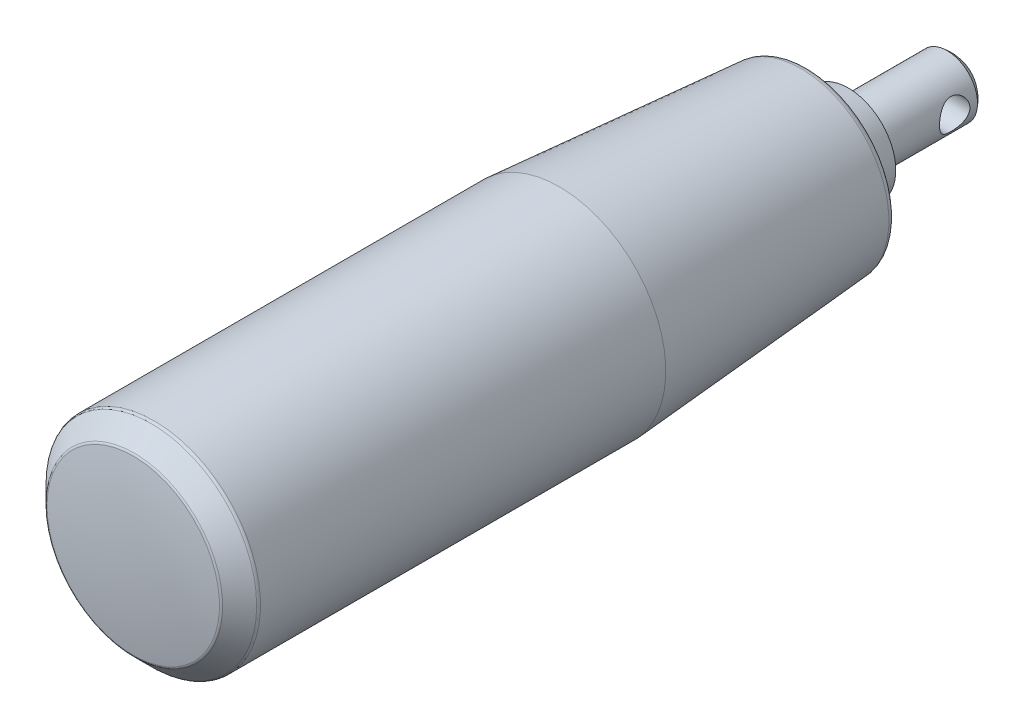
ISO-10303-21;
HEADER;
FILE_DESCRIPTION(('STEP AP214'),'2;1');
FILE_NAME('part.step','',(''),(''),'','','');
FILE_SCHEMA(('AUTOMOTIVE_DESIGN { 1 0 10303 214 1 1 1 1 }'));
ENDSEC;
DATA;
#1=APPLICATION_CONTEXT('core data for automotive mechanical design processes');
#2=APPLICATION_PROTOCOL_DEFINITION('international standard','automotive_design',2000,#1);
#3=PRODUCT_CONTEXT('',#1,'mechanical');
#4=PRODUCT('Part','Part','',(#3));
#5=PRODUCT_RELATED_PRODUCT_CATEGORY('part','',(#4));
#6=PRODUCT_DEFINITION_FORMATION('','',#4);
#7=PRODUCT_DEFINITION_CONTEXT('part definition',#1,'design');
#8=PRODUCT_DEFINITION('design','',#6,#7);
#9=PRODUCT_DEFINITION_SHAPE('','',#8);
#10=(LENGTH_UNIT() NAMED_UNIT(*) SI_UNIT(.MILLI.,.METRE.));
#11=(NAMED_UNIT(*) PLANE_ANGLE_UNIT() SI_UNIT($,.RADIAN.));
#12=(NAMED_UNIT(*) SI_UNIT($,.STERADIAN.) SOLID_ANGLE_UNIT());
#13=UNCERTAINTY_MEASURE_WITH_UNIT(LENGTH_MEASURE(1.E-05),#10,'distance_accuracy_value','');
#14=(GEOMETRIC_REPRESENTATION_CONTEXT(3) GLOBAL_UNCERTAINTY_ASSIGNED_CONTEXT((#13)) GLOBAL_UNIT_ASSIGNED_CONTEXT((#10,
#11,#12)) REPRESENTATION_CONTEXT('',''));
#15=CARTESIAN_POINT('',(0.,0.,0.));
#16=DIRECTION('',(0.,0.,1.));
#17=DIRECTION('',(1.,0.,0.));
#18=AXIS2_PLACEMENT_3D('',#15,#16,#17);
#19=CARTESIAN_POINT('',(0.,0.,38.375));
#20=DIRECTION('',(1.,0.,0.));
#21=DIRECTION('',(0.,0.,-1.));
#22=AXIS2_PLACEMENT_3D('',#19,#20,#21);
#23=SPHERICAL_SURFACE('',#22,66.625);
#24=CARTESIAN_POINT('',(0.,0.,38.375));
#25=DIRECTION('',(0.,0.,-1.));
#26=DIRECTION('',(-1.,0.,0.));
#27=AXIS2_PLACEMENT_3D('',#24,#25,#26);
#28=SPHERICAL_SURFACE('',#27,66.625);
#29=CARTESIAN_POINT('',(0.,0.,104.027234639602));
#30=DIRECTION('',(0.,0.,-1.));
#31=DIRECTION('',(-1.,0.,0.));
#32=AXIS2_PLACEMENT_3D('',#29,#30,#31);
#33=CIRCLE('',#32,11.343487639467);
#34=CARTESIAN_POINT('',(-11.343487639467,0.,104.027234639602));
#35=VERTEX_POINT('',#34);
#36=EDGE_CURVE('E105',#35,#35,#33,.T.);
#37=ORIENTED_EDGE('',*,*,#36,.F.);
#38=EDGE_LOOP('',(#37));
#39=FACE_BOUND('',#38,.T.);
#40=ADVANCED_FACE('F12',(#39),#28,.T.);
#41=CARTESIAN_POINT('',(0.,0.,0.));
#42=DIRECTION('',(1.,0.,0.));
#43=DIRECTION('',(0.,0.,-1.));
#44=AXIS2_PLACEMENT_3D('',#41,#42,#43);
#45=SPHERICAL_SURFACE('',#44,5.);
#46=CARTESIAN_POINT('',(0.,0.,0.));
#47=DIRECTION('',(0.,0.,-1.));
#48=DIRECTION('',(-1.,0.,0.));
#49=AXIS2_PLACEMENT_3D('',#46,#47,#48);
#50=SPHERICAL_SURFACE('',#49,5.);
#51=CARTESIAN_POINT('',(0.,0.,-3.));
#52=DIRECTION('',(0.,0.,-1.));
#53=DIRECTION('',(-1.,0.,0.));
#54=AXIS2_PLACEMENT_3D('',#51,#52,#53);
#55=CIRCLE('',#54,4.);
#56=CARTESIAN_POINT('',(-4.,0.,-3.));
#57=VERTEX_POINT('',#56);
#58=EDGE_CURVE('E8',#57,#57,#55,.T.);
#59=ORIENTED_EDGE('',*,*,#58,.T.);
#60=EDGE_LOOP('',(#59));
#61=FACE_BOUND('',#60,.T.);
#62=ADVANCED_FACE('F93',(#61),#50,.T.);
#63=CARTESIAN_POINT('',(0.,0.,-8.));
#64=DIRECTION('',(0.,0.,-1.));
#65=DIRECTION('',(-1.,0.,0.));
#66=AXIS2_PLACEMENT_3D('',#63,#64,#65);
#67=CYLINDRICAL_SURFACE('',#66,4.);
#68=CARTESIAN_POINT('',(-4.,0.,2.));
#69=CARTESIAN_POINT('',(-3.99999426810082,0.1051439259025,1.99999339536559));
#70=CARTESIAN_POINT('',(-3.99580982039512,0.21041319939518,1.99165985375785));
#71=CARTESIAN_POINT('',(-3.97948312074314,0.417840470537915,1.95869423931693));
#72=CARTESIAN_POINT('',(-3.9673257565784,0.519992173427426,1.93403121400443));
#73=CARTESIAN_POINT('',(-3.93632558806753,0.717867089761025,1.86961238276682));
#74=CARTESIAN_POINT('',(-3.91750878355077,0.813613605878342,1.82991523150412));
#75=CARTESIAN_POINT('',(-3.87491553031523,0.996945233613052,1.73685875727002));
#76=CARTESIAN_POINT('',(-3.85113947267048,1.08453098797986,1.68350051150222));
#77=CARTESIAN_POINT('',(-3.79912516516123,1.25501563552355,1.56096550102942));
#78=CARTESIAN_POINT('',(-3.77070398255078,1.33731042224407,1.49102704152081));
#79=CARTESIAN_POINT('',(-3.71319940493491,1.48955888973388,1.33895704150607));
#80=CARTESIAN_POINT('',(-3.68411552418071,1.55950316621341,1.25681629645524));
#81=CARTESIAN_POINT('',(-3.62597902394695,1.69050400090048,1.07503330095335));
#82=CARTESIAN_POINT('',(-3.59710373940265,1.7504506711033,0.974527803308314));
#83=CARTESIAN_POINT('',(-3.54571957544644,1.85233645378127,0.763265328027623));
#84=CARTESIAN_POINT('',(-3.52320615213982,1.8942884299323,0.652515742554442));
#85=CARTESIAN_POINT('',(-3.48915734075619,1.95626488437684,0.430669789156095));
#86=CARTESIAN_POINT('',(-3.47704543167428,1.97745171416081,0.319991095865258));
#87=CARTESIAN_POINT('',(-3.46363779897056,2.00085398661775,0.0960423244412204));
#88=CARTESIAN_POINT('',(-3.46233138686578,2.00308817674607,-0.0172250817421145));
#89=CARTESIAN_POINT('',(-3.47021860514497,1.98937457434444,-0.228572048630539));
#90=CARTESIAN_POINT('',(-3.47817527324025,1.97556911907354,-0.326848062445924));
#91=CARTESIAN_POINT('',(-3.50152457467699,1.93387969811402,-0.519443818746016));
#92=CARTESIAN_POINT('',(-3.51691957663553,1.90599124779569,-0.613762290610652));
#93=CARTESIAN_POINT('',(-3.55374952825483,1.83641956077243,-0.798458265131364));
#94=CARTESIAN_POINT('',(-3.57531681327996,1.7944301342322,-0.888692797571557));
#95=CARTESIAN_POINT('',(-3.62206808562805,1.69808337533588,-1.06126858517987));
#96=CARTESIAN_POINT('',(-3.64725369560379,1.64372048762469,-1.14360627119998));
#97=CARTESIAN_POINT('',(-3.70226315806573,1.51613210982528,-1.30904250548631));
#98=CARTESIAN_POINT('',(-3.73227020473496,1.44138891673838,-1.39091374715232));
#99=CARTESIAN_POINT('',(-3.79095246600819,1.27911115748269,-1.54147083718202));
#100=CARTESIAN_POINT('',(-3.81962703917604,1.19157051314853,-1.61015038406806));
#101=CARTESIAN_POINT('',(-3.87403974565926,1.0010330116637,-1.73537132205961));
#102=CARTESIAN_POINT('',(-3.89957968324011,0.897507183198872,-1.79120094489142));
#103=CARTESIAN_POINT('',(-3.94315762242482,0.680932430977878,-1.88419405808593));
#104=CARTESIAN_POINT('',(-3.96120157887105,0.567891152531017,-1.92137237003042));
#105=CARTESIAN_POINT('',(-3.98648667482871,0.345532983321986,-1.97295080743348));
#106=CARTESIAN_POINT('',(-3.99449876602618,0.236683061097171,-1.98898247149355));
#107=CARTESIAN_POINT('',(-4.00146026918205,0.0175591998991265,-2.00292946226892));
#108=CARTESIAN_POINT('',(-4.00041397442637,-0.0927140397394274,-2.00085337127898));
#109=CARTESIAN_POINT('',(-3.9898238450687,-0.302465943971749,-1.97958662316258));
#110=CARTESIAN_POINT('',(-3.98094491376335,-0.402118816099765,-1.96173493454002));
#111=CARTESIAN_POINT('',(-3.95644342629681,-0.59681378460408,-1.91152385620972));
#112=CARTESIAN_POINT('',(-3.94082012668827,-0.691855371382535,-1.87916286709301));
#113=CARTESIAN_POINT('',(-3.90368502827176,-0.877777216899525,-1.80000306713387));
#114=CARTESIAN_POINT('',(-3.88201763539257,-0.968460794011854,-1.7528178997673));
#115=CARTESIAN_POINT('',(-3.83487948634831,-1.14092272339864,-1.64578492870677));
#116=CARTESIAN_POINT('',(-3.80940711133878,-1.22269725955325,-1.58593173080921));
#117=CARTESIAN_POINT('',(-3.75416442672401,-1.38353537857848,-1.44847914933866));
#118=CARTESIAN_POINT('',(-3.72421769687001,-1.4615441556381,-1.36971426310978));
#119=CARTESIAN_POINT('',(-3.6652478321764,-1.60371264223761,-1.20014969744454));
#120=CARTESIAN_POINT('',(-3.63622534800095,-1.6678627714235,-1.10934176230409));
#121=CARTESIAN_POINT('',(-3.58102384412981,-1.78341582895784,-0.912712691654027));
#122=CARTESIAN_POINT('',(-3.55505059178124,-1.83405099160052,-0.806377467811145));
#123=CARTESIAN_POINT('',(-3.51148144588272,-1.91616565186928,-0.58497986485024));
#124=CARTESIAN_POINT('',(-3.49387476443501,-1.94766983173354,-0.469928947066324));
#125=CARTESIAN_POINT('',(-3.47123002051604,-1.9877233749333,-0.246179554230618));
#126=CARTESIAN_POINT('',(-3.4651476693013,-1.99818599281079,-0.137931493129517));
#127=CARTESIAN_POINT('',(-3.46330709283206,-2.00137830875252,0.0788941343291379));
#128=CARTESIAN_POINT('',(-3.46754439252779,-1.99411569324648,0.187471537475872));
#129=CARTESIAN_POINT('',(-3.48475724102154,-1.96385225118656,0.3909670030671));
#130=CARTESIAN_POINT('',(-3.49686188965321,-1.94241662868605,0.486200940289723));
#131=CARTESIAN_POINT('',(-3.52742032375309,-1.8863507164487,0.671616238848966));
#132=CARTESIAN_POINT('',(-3.54587615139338,-1.85171618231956,0.761795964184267));
#133=CARTESIAN_POINT('',(-3.5885706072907,-1.76763149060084,0.941249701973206));
#134=CARTESIAN_POINT('',(-3.61311444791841,-1.7173422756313,1.03005580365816));
#135=CARTESIAN_POINT('',(-3.66470663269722,-1.60430194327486,1.19854907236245));
#136=CARTESIAN_POINT('',(-3.69175627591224,-1.54154434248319,1.278231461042));
#137=CARTESIAN_POINT('',(-3.74924646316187,-1.39640665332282,1.43628396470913));
#138=CARTESIAN_POINT('',(-3.77969966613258,-1.31256884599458,1.51331820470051));
#139=CARTESIAN_POINT('',(-3.8375550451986,-1.13230961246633,1.65252596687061));
#140=CARTESIAN_POINT('',(-3.86495557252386,-1.03588144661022,1.71469147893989));
#141=CARTESIAN_POINT('',(-3.91396019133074,-0.831863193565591,1.82247272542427));
#142=CARTESIAN_POINT('',(-3.93552192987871,-0.724199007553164,1.86796833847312));
#143=CARTESIAN_POINT('',(-3.97002682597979,-0.501484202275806,1.93961633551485));
#144=CARTESIAN_POINT('',(-3.98299446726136,-0.38645559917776,1.96582369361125));
#145=CARTESIAN_POINT('',(-3.99390923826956,-0.225203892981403,1.98779482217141));
#146=CARTESIAN_POINT('',(-3.99618730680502,-0.180323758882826,1.99236528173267));
#147=CARTESIAN_POINT('',(-3.99923393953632,-0.0903034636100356,1.99846933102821));
#148=CARTESIAN_POINT('',(-4.00000246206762,-0.0451632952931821,2.00000283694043));
#149=CARTESIAN_POINT('',(-4.,0.,2.));
#150=B_SPLINE_CURVE_WITH_KNOTS('',3,(#68,#69,#70,#71,#72,#73,#74,#75,#76,#77,#78,#79,#80,#81,
#82,#83,#84,#85,#86,#87,#88,#89,#90,#91,#92,#93,#94,#95,#96,#97,#98,#99,#100,#101,#102,#103,
#104,#105,#106,#107,#108,#109,#110,#111,#112,#113,#114,#115,#116,#117,#118,#119,#120,#121,#122,
#123,#124,#125,#126,#127,#128,#129,#130,#131,#132,#133,#134,#135,#136,#137,#138,#139,#140,#141,
#142,#143,#144,#145,#146,#147,#148,#149),.UNSPECIFIED.,.T.,.F.,(4,2,2,2,2,2,2,2,2,2,2,2,2,2,2,2,
2,2,2,2,2,2,2,2,2,2,2,2,2,2,2,2,2,2,2,2,2,2,2,2,4),(0.,0.315248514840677,0.631096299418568,
0.945724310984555,1.26032752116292,1.59396351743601,1.9278524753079,2.28763452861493,
2.64715895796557,2.9851602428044,3.3228271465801,3.6201142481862,3.9174960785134,
4.2218048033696,4.5262504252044,4.86929882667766,5.21251069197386,5.57166044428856,
5.930524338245,6.25966580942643,6.58865129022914,6.89213813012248,7.19565843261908,
7.50785712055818,7.82018901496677,8.16319221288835,8.50643177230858,8.86629364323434,
9.22569023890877,9.55058615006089,9.87534119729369,10.1691586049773,10.4630705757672,
10.7767291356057,11.0905512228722,11.4425048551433,11.7946476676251,12.1492802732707,
12.5028981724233,12.6383056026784,12.7737167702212),.UNSPECIFIED.);
#151=CARTESIAN_POINT('',(-4.,0.,2.));
#152=VERTEX_POINT('',#151);
#153=EDGE_CURVE('E15',#152,#152,#150,.T.);
#154=ORIENTED_EDGE('',*,*,#153,.F.);
#155=EDGE_LOOP('',(#154));
#156=FACE_BOUND('',#155,.T.);
#157=CARTESIAN_POINT('',(4.,0.,-2.));
#158=CARTESIAN_POINT('',(3.99999426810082,0.105143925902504,-1.99999339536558));
#159=CARTESIAN_POINT('',(3.99580982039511,0.210413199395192,-1.99165985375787));
#160=CARTESIAN_POINT('',(3.97948312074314,0.417840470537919,-1.95869423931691));
#161=CARTESIAN_POINT('',(3.96732575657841,0.519992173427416,-1.93403121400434));
#162=CARTESIAN_POINT('',(3.93632558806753,0.717867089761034,-1.86961238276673));
#163=CARTESIAN_POINT('',(3.91750878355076,0.813613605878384,-1.8299152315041));
#164=CARTESIAN_POINT('',(3.87491553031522,0.996945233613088,-1.73685875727));
#165=CARTESIAN_POINT('',(3.85113947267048,1.08453098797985,-1.68350051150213));
#166=CARTESIAN_POINT('',(3.79912516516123,1.25501563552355,-1.56096550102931));
#167=CARTESIAN_POINT('',(3.77070398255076,1.33731042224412,-1.49102704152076));
#168=CARTESIAN_POINT('',(3.71319940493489,1.48955888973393,-1.33895704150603));
#169=CARTESIAN_POINT('',(3.68411552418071,1.55950316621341,-1.25681629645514));
#170=CARTESIAN_POINT('',(3.62597902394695,1.69050400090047,-1.07503330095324));
#171=CARTESIAN_POINT('',(3.59710373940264,1.75045067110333,-0.974527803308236));
#172=CARTESIAN_POINT('',(3.54571957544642,1.85233645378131,-0.763265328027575));
#173=CARTESIAN_POINT('',(3.52320615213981,1.89428842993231,-0.652515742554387));
#174=CARTESIAN_POINT('',(3.48915734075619,1.95626488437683,-0.430669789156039));
#175=CARTESIAN_POINT('',(3.47704543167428,1.97745171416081,-0.319991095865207));
#176=CARTESIAN_POINT('',(3.46363779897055,2.00085398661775,-0.0960423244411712));
#177=CARTESIAN_POINT('',(3.46233138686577,2.00308817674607,0.0172250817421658));
#178=CARTESIAN_POINT('',(3.47021860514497,1.98937457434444,0.228572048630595));
#179=CARTESIAN_POINT('',(3.47817527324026,1.97556911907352,0.326848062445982));
#180=CARTESIAN_POINT('',(3.501524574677,1.93387969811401,0.519443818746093));
#181=CARTESIAN_POINT('',(3.51691957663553,1.9059912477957,0.613762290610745));
#182=CARTESIAN_POINT('',(3.55374952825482,1.83641956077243,0.798458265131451));
#183=CARTESIAN_POINT('',(3.57531681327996,1.79443013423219,0.888692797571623));
#184=CARTESIAN_POINT('',(3.62206808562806,1.69808337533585,1.06126858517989));
#185=CARTESIAN_POINT('',(3.6472536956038,1.64372048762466,1.14360627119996));
#186=CARTESIAN_POINT('',(3.70226315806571,1.51613210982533,1.30904250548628));
#187=CARTESIAN_POINT('',(3.73227020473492,1.44138891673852,1.39091374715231));
#188=CARTESIAN_POINT('',(3.79095246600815,1.27911115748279,1.54147083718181));
#189=CARTESIAN_POINT('',(3.81962703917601,1.1915705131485,1.61015038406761));
#190=CARTESIAN_POINT('',(3.87403974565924,1.00103301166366,1.73537132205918));
#191=CARTESIAN_POINT('',(3.89957968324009,0.897507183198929,1.79120094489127));
#192=CARTESIAN_POINT('',(3.9431576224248,0.680932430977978,1.88419405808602));
#193=CARTESIAN_POINT('',(3.96120157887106,0.567891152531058,1.92137237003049));
#194=CARTESIAN_POINT('',(3.98648667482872,0.34553298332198,1.97295080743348));
#195=CARTESIAN_POINT('',(3.99449876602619,0.236683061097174,1.98898247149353));
#196=CARTESIAN_POINT('',(4.00146026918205,0.017559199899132,2.00292946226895));
#197=CARTESIAN_POINT('',(4.00041397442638,-0.0927140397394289,2.00085337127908));
#198=CARTESIAN_POINT('',(3.98982384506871,-0.302465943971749,1.97958662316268));
#199=CARTESIAN_POINT('',(3.98094491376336,-0.402118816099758,1.96173493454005));
#200=CARTESIAN_POINT('',(3.95644342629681,-0.596813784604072,1.9115238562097));
#201=CARTESIAN_POINT('',(3.94082012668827,-0.691855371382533,1.879162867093));
#202=CARTESIAN_POINT('',(3.90368502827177,-0.877777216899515,1.80000306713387));
#203=CARTESIAN_POINT('',(3.88201763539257,-0.96846079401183,1.75281789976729));
#204=CARTESIAN_POINT('',(3.83487948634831,-1.14092272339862,1.64578492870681));
#205=CARTESIAN_POINT('',(3.80940711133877,-1.22269725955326,1.5859317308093));
#206=CARTESIAN_POINT('',(3.75416442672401,-1.38353537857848,1.44847914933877));
#207=CARTESIAN_POINT('',(3.72421769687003,-1.46154415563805,1.36971426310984));
#208=CARTESIAN_POINT('',(3.66524783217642,-1.60371264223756,1.20014969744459));
#209=CARTESIAN_POINT('',(3.63622534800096,-1.66786277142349,1.10934176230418));
#210=CARTESIAN_POINT('',(3.58102384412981,-1.78341582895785,0.91271269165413));
#211=CARTESIAN_POINT('',(3.55505059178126,-1.8340509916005,0.806377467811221));
#212=CARTESIAN_POINT('',(3.51148144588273,-1.91616565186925,0.58497986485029));
#213=CARTESIAN_POINT('',(3.49387476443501,-1.94766983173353,0.469928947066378));
#214=CARTESIAN_POINT('',(3.47123002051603,-1.98772337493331,0.246179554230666));
#215=CARTESIAN_POINT('',(3.4651476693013,-1.9981859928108,0.137931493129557));
#216=CARTESIAN_POINT('',(3.46330709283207,-2.00137830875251,-0.0788941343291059));
#217=CARTESIAN_POINT('',(3.46754439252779,-1.99411569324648,-0.18747153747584));
#218=CARTESIAN_POINT('',(3.48475724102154,-1.96385225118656,-0.390967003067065));
#219=CARTESIAN_POINT('',(3.49686188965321,-1.94241662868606,-0.486200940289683));
#220=CARTESIAN_POINT('',(3.52742032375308,-1.88635071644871,-0.671616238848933));
#221=CARTESIAN_POINT('',(3.54587615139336,-1.85171618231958,-0.761795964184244));
#222=CARTESIAN_POINT('',(3.58857060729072,-1.7676314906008,-0.941249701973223));
#223=CARTESIAN_POINT('',(3.61311444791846,-1.71734227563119,-1.0300558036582));
#224=CARTESIAN_POINT('',(3.66470663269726,-1.60430194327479,-1.19854907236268));
#225=CARTESIAN_POINT('',(3.69175627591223,-1.54154434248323,-1.27823146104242));
#226=CARTESIAN_POINT('',(3.74924646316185,-1.39640665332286,-1.43628396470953));
#227=CARTESIAN_POINT('',(3.7796996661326,-1.31256884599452,-1.51331820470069));
#228=CARTESIAN_POINT('',(3.83755504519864,-1.13230961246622,-1.65252596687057));
#229=CARTESIAN_POINT('',(3.86495557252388,-1.03588144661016,-1.71469147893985));
#230=CARTESIAN_POINT('',(3.91396019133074,-0.831863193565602,-1.82247272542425));
#231=CARTESIAN_POINT('',(3.93552192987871,-0.72419900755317,-1.86796833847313));
#232=CARTESIAN_POINT('',(3.97002682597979,-0.501484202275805,-1.93961633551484));
#233=CARTESIAN_POINT('',(3.98299446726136,-0.386455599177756,-1.9658236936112));
#234=CARTESIAN_POINT('',(3.99390923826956,-0.225203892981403,-1.98779482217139));
#235=CARTESIAN_POINT('',(3.99618730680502,-0.180323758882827,-1.99236528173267));
#236=CARTESIAN_POINT('',(3.99923393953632,-0.0903034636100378,-1.99846933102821));
#237=CARTESIAN_POINT('',(4.00000246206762,-0.0451632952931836,-2.00000283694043));
#238=CARTESIAN_POINT('',(4.,0.,-2.));
#239=B_SPLINE_CURVE_WITH_KNOTS('',3,(#157,#158,#159,#160,#161,#162,#163,#164,#165,#166,#167,
#168,#169,#170,#171,#172,#173,#174,#175,#176,#177,#178,#179,#180,#181,#182,#183,#184,#185,#186,
#187,#188,#189,#190,#191,#192,#193,#194,#195,#196,#197,#198,#199,#200,#201,#202,#203,#204,#205,
#206,#207,#208,#209,#210,#211,#212,#213,#214,#215,#216,#217,#218,#219,#220,#221,#222,#223,#224,
#225,#226,#227,#228,#229,#230,#231,#232,#233,#234,#235,#236,#237,#238),.UNSPECIFIED.,.T.,.F.,(4,
2,2,2,2,2,2,2,2,2,2,2,2,2,2,2,2,2,2,2,2,2,2,2,2,2,2,2,2,2,2,2,2,2,2,2,2,2,2,2,4),(0.,
0.315248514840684,0.631096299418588,0.945724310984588,1.26032752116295,1.59396351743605,
1.92785247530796,2.28763452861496,2.64715895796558,2.98516024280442,3.32282714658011,
3.62011424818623,3.91749607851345,4.22180480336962,4.52625042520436,4.86929882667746,
5.21251069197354,5.57166044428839,5.93052433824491,6.25966580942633,6.58865129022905,
6.8921381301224,7.19565843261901,7.50785712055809,7.82018901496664,8.16319221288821,
8.50643177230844,8.86629364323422,9.22569023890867,9.55058615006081,9.8753411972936,
10.1691586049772,10.4630705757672,10.7767291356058,11.0905512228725,11.4425048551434,
11.794647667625,12.1492802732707,12.5028981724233,12.6383056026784,12.7737167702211),.UNSPECIFIED.);
#240=CARTESIAN_POINT('',(4.,0.,-2.));
#241=VERTEX_POINT('',#240);
#242=EDGE_CURVE('E32',#241,#241,#239,.T.);
#243=ORIENTED_EDGE('',*,*,#242,.F.);
#244=EDGE_LOOP('',(#243));
#245=FACE_BOUND('',#244,.T.);
#246=CARTESIAN_POINT('',(0.,0.,10.));
#247=DIRECTION('',(0.,0.,-1.));
#248=DIRECTION('',(-1.,0.,0.));
#249=AXIS2_PLACEMENT_3D('',#246,#247,#248);
#250=CIRCLE('',#249,4.);
#251=CARTESIAN_POINT('',(-4.,0.,10.));
#252=VERTEX_POINT('',#251);
#253=EDGE_CURVE('E24',#252,#252,#250,.T.);
#254=ORIENTED_EDGE('',*,*,#253,.T.);
#255=EDGE_LOOP('',(#254));
#256=FACE_BOUND('',#255,.T.);
#257=ORIENTED_EDGE('',*,*,#58,.F.);
#258=EDGE_LOOP('',(#257));
#259=FACE_BOUND('',#258,.T.);
#260=ADVANCED_FACE('F37',(#156,#245,#256,#259),#67,.T.);
#261=CARTESIAN_POINT('',(0.,4.,10.));
#262=DIRECTION('',(0.,0.,-1.));
#263=DIRECTION('',(-1.,0.,0.));
#264=AXIS2_PLACEMENT_3D('',#261,#262,#263);
#265=PLANE('',#264);
#266=CARTESIAN_POINT('',(0.,0.,10.));
#267=DIRECTION('',(0.,0.,-1.));
#268=DIRECTION('',(-1.,0.,0.));
#269=AXIS2_PLACEMENT_3D('',#266,#267,#268);
#270=CIRCLE('',#269,6.25);
#271=CARTESIAN_POINT('',(-6.25,0.,10.));
#272=VERTEX_POINT('',#271);
#273=EDGE_CURVE('E29',#272,#272,#270,.T.);
#274=ORIENTED_EDGE('',*,*,#273,.T.);
#275=EDGE_LOOP('',(#274));
#276=FACE_BOUND('',#275,.T.);
#277=ORIENTED_EDGE('',*,*,#253,.F.);
#278=EDGE_LOOP('',(#277));
#279=FACE_BOUND('',#278,.T.);
#280=ADVANCED_FACE('F84',(#276,#279),#265,.T.);
#281=CARTESIAN_POINT('',(0.,0.,15.));
#282=DIRECTION('',(0.,0.,1.));
#283=DIRECTION('',(1.,0.,0.));
#284=AXIS2_PLACEMENT_3D('',#281,#282,#283);
#285=CONICAL_SURFACE('',#284,7.,0.148889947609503);
#286=ORIENTED_EDGE('',*,*,#273,.F.);
#287=EDGE_LOOP('',(#286));
#288=FACE_BOUND('',#287,.T.);
#289=CARTESIAN_POINT('',(0.,0.,15.));
#290=DIRECTION('',(0.,0.,-1.));
#291=DIRECTION('',(-1.,0.,0.));
#292=AXIS2_PLACEMENT_3D('',#289,#290,#291);
#293=CIRCLE('',#292,7.);
#294=CARTESIAN_POINT('',(-7.,0.,15.));
#295=VERTEX_POINT('',#294);
#296=EDGE_CURVE('E133',#295,#295,#293,.T.);
#297=ORIENTED_EDGE('',*,*,#296,.T.);
#298=EDGE_LOOP('',(#297));
#299=FACE_BOUND('',#298,.T.);
#300=ADVANCED_FACE('F81',(#288,#299),#285,.T.);
#301=CARTESIAN_POINT('',(0.,8.5,15.));
#302=DIRECTION('',(0.,0.,1.));
#303=DIRECTION('',(1.,0.,0.));
#304=AXIS2_PLACEMENT_3D('',#301,#302,#303);
#305=PLANE('',#304);
#306=ORIENTED_EDGE('',*,*,#296,.F.);
#307=EDGE_LOOP('',(#306));
#308=FACE_BOUND('',#307,.T.);
#309=CARTESIAN_POINT('',(0.,0.,15.));
#310=DIRECTION('',(0.,0.,-1.));
#311=DIRECTION('',(-1.,0.,0.));
#312=AXIS2_PLACEMENT_3D('',#309,#310,#311);
#313=CIRCLE('',#312,8.5);
#314=CARTESIAN_POINT('',(-8.5,0.,15.));
#315=VERTEX_POINT('',#314);
#316=EDGE_CURVE('E130',#315,#315,#313,.T.);
#317=ORIENTED_EDGE('',*,*,#316,.T.);
#318=EDGE_LOOP('',(#317));
#319=FACE_BOUND('',#318,.T.);
#320=ADVANCED_FACE('F77',(#308,#319),#305,.F.);
#321=CARTESIAN_POINT('',(0.,0.,-8.));
#322=DIRECTION('',(0.,0.,-1.));
#323=DIRECTION('',(-1.,0.,0.));
#324=AXIS2_PLACEMENT_3D('',#321,#322,#323);
#325=CYLINDRICAL_SURFACE('',#324,8.5);
#326=ORIENTED_EDGE('',*,*,#316,.F.);
#327=EDGE_LOOP('',(#326));
#328=FACE_BOUND('',#327,.T.);
#329=CARTESIAN_POINT('',(0.,0.,15.3));
#330=DIRECTION('',(0.,0.,-1.));
#331=DIRECTION('',(-1.,0.,0.));
#332=AXIS2_PLACEMENT_3D('',#329,#330,#331);
#333=CIRCLE('',#332,8.5);
#334=CARTESIAN_POINT('',(-8.5,0.,15.3));
#335=VERTEX_POINT('',#334);
#336=EDGE_CURVE('E127',#335,#335,#333,.T.);
#337=ORIENTED_EDGE('',*,*,#336,.T.);
#338=EDGE_LOOP('',(#337));
#339=FACE_BOUND('',#338,.T.);
#340=ADVANCED_FACE('F73',(#328,#339),#325,.T.);
#341=CARTESIAN_POINT('',(0.,10.57353435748,15.3));
#342=DIRECTION('',(0.,0.,1.));
#343=DIRECTION('',(1.,0.,0.));
#344=AXIS2_PLACEMENT_3D('',#341,#342,#343);
#345=PLANE('',#344);
#346=ORIENTED_EDGE('',*,*,#336,.F.);
#347=EDGE_LOOP('',(#346));
#348=FACE_BOUND('',#347,.T.);
#349=CARTESIAN_POINT('',(0.,0.,15.3));
#350=DIRECTION('',(0.,0.,-1.));
#351=DIRECTION('',(-1.,0.,0.));
#352=AXIS2_PLACEMENT_3D('',#349,#350,#351);
#353=CIRCLE('',#352,10.5735343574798);
#354=CARTESIAN_POINT('',(-10.5735343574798,0.,15.3));
#355=VERTEX_POINT('',#354);
#356=EDGE_CURVE('E124',#355,#355,#353,.T.);
#357=ORIENTED_EDGE('',*,*,#356,.T.);
#358=EDGE_LOOP('',(#357));
#359=FACE_BOUND('',#358,.T.);
#360=ADVANCED_FACE('F69',(#348,#359),#345,.F.);
#361=CARTESIAN_POINT('',(0.,0.,16.3));
#362=DIRECTION('',(0.,0.,-1.));
#363=DIRECTION('',(-1.,0.,0.));
#364=AXIS2_PLACEMENT_3D('',#361,#362,#363);
#365=TOROIDAL_SURFACE('',#364,10.5735343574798,0.99999999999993);
#366=CARTESIAN_POINT('',(0.,0.,16.223769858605));
#367=DIRECTION('',(0.,0.,-1.));
#368=DIRECTION('',(-1.,0.,0.));
#369=AXIS2_PLACEMENT_3D('',#366,#367,#368);
#370=CIRCLE('',#369,11.570624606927);
#371=CARTESIAN_POINT('',(-11.570624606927,0.,16.223769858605));
#372=VERTEX_POINT('',#371);
#373=EDGE_CURVE('E121',#372,#372,#370,.T.);
#374=ORIENTED_EDGE('',*,*,#373,.T.);
#375=EDGE_LOOP('',(#374));
#376=FACE_BOUND('',#375,.T.);
#377=ORIENTED_EDGE('',*,*,#356,.F.);
#378=EDGE_LOOP('',(#377));
#379=FACE_BOUND('',#378,.T.);
#380=ADVANCED_FACE('F65',(#376,#379),#365,.T.);
#381=CARTESIAN_POINT('',(0.,0.,48.));
#382=DIRECTION('',(0.,0.,1.));
#383=DIRECTION('',(1.,0.,0.));
#384=AXIS2_PLACEMENT_3D('',#381,#382,#383);
#385=CONICAL_SURFACE('',#384,14.,0.0763041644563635);
#386=ORIENTED_EDGE('',*,*,#373,.F.);
#387=EDGE_LOOP('',(#386));
#388=FACE_BOUND('',#387,.T.);
#389=CARTESIAN_POINT('',(0.,0.,48.));
#390=DIRECTION('',(0.,0.,-1.));
#391=DIRECTION('',(-1.,0.,0.));
#392=AXIS2_PLACEMENT_3D('',#389,#390,#391);
#393=CIRCLE('',#392,14.);
#394=CARTESIAN_POINT('',(-14.,0.,48.));
#395=VERTEX_POINT('',#394);
#396=EDGE_CURVE('E118',#395,#395,#393,.T.);
#397=ORIENTED_EDGE('',*,*,#396,.T.);
#398=EDGE_LOOP('',(#397));
#399=FACE_BOUND('',#398,.T.);
#400=ADVANCED_FACE('F61',(#388,#399),#385,.T.);
#401=CARTESIAN_POINT('',(0.,0.,-8.));
#402=DIRECTION('',(0.,0.,-1.));
#403=DIRECTION('',(-1.,0.,0.));
#404=AXIS2_PLACEMENT_3D('',#401,#402,#403);
#405=CYLINDRICAL_SURFACE('',#404,14.);
#406=ORIENTED_EDGE('',*,*,#396,.F.);
#407=EDGE_LOOP('',(#406));
#408=FACE_BOUND('',#407,.T.);
#409=CARTESIAN_POINT('',(0.,0.,101.292893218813));
#410=DIRECTION('',(0.,0.,-1.));
#411=DIRECTION('',(-1.,0.,0.));
#412=AXIS2_PLACEMENT_3D('',#409,#410,#411);
#413=CIRCLE('',#412,14.);
#414=CARTESIAN_POINT('',(-14.,0.,101.292893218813));
#415=VERTEX_POINT('',#414);
#416=EDGE_CURVE('E115',#415,#415,#413,.T.);
#417=ORIENTED_EDGE('',*,*,#416,.T.);
#418=EDGE_LOOP('',(#417));
#419=FACE_BOUND('',#418,.T.);
#420=ADVANCED_FACE('F57',(#408,#419),#405,.T.);
#421=CARTESIAN_POINT('',(0.,0.,101.292893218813));
#422=DIRECTION('',(0.,0.,-1.));
#423=DIRECTION('',(-1.,0.,0.));
#424=AXIS2_PLACEMENT_3D('',#421,#422,#423);
#425=TOROIDAL_SURFACE('',#424,13.5,0.500000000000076);
#426=CARTESIAN_POINT('',(0.,0.,101.646446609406));
#427=DIRECTION('',(0.,0.,-1.));
#428=DIRECTION('',(-1.,0.,0.));
#429=AXIS2_PLACEMENT_3D('',#426,#427,#428);
#430=CIRCLE('',#429,13.8535533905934);
#431=CARTESIAN_POINT('',(-13.8535533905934,0.,101.646446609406));
#432=VERTEX_POINT('',#431);
#433=EDGE_CURVE('E109',#432,#432,#430,.T.);
#434=ORIENTED_EDGE('',*,*,#433,.T.);
#435=EDGE_LOOP('',(#434));
#436=FACE_BOUND('',#435,.T.);
#437=ORIENTED_EDGE('',*,*,#416,.F.);
#438=EDGE_LOOP('',(#437));
#439=FACE_BOUND('',#438,.T.);
#440=ADVANCED_FACE('F53',(#436,#439),#425,.T.);
#441=CARTESIAN_POINT('',(0.,0.,103.888088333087));
#442=DIRECTION('',(0.,0.,-1.));
#443=DIRECTION('',(-1.,0.,0.));
#444=AXIS2_PLACEMENT_3D('',#441,#442,#443);
#445=CONICAL_SURFACE('',#444,11.6119116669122,0.785398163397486);
#446=ORIENTED_EDGE('',*,*,#433,.F.);
#447=EDGE_LOOP('',(#446));
#448=FACE_BOUND('',#447,.T.);
#449=CARTESIAN_POINT('',(0.,0.,103.888088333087));
#450=DIRECTION('',(0.,0.,-1.));
#451=DIRECTION('',(-1.,0.,0.));
#452=AXIS2_PLACEMENT_3D('',#449,#450,#451);
#453=CIRCLE('',#452,11.6119116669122);
#454=CARTESIAN_POINT('',(-11.6119116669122,0.,103.888088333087));
#455=VERTEX_POINT('',#454);
#456=EDGE_CURVE('E106',#455,#455,#453,.T.);
#457=ORIENTED_EDGE('',*,*,#456,.T.);
#458=EDGE_LOOP('',(#457));
#459=FACE_BOUND('',#458,.T.);
#460=ADVANCED_FACE('F49',(#448,#459),#445,.T.);
#461=CARTESIAN_POINT('',(0.,0.,103.534534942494));
#462=DIRECTION('',(0.,0.,-1.));
#463=DIRECTION('',(-1.,0.,0.));
#464=AXIS2_PLACEMENT_3D('',#461,#462,#463);
#465=TOROIDAL_SURFACE('',#464,11.258358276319,0.499999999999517);
#466=ORIENTED_EDGE('',*,*,#36,.T.);
#467=EDGE_LOOP('',(#466));
#468=FACE_BOUND('',#467,.T.);
#469=ORIENTED_EDGE('',*,*,#456,.F.);
#470=EDGE_LOOP('',(#469));
#471=FACE_BOUND('',#470,.T.);
#472=ADVANCED_FACE('F44',(#468,#471),#465,.T.);
#473=CARTESIAN_POINT('',(-14.,0.,0.));
#474=DIRECTION('',(1.,0.,0.));
#475=DIRECTION('',(0.,0.,-1.));
#476=AXIS2_PLACEMENT_3D('',#473,#474,#475);
#477=CYLINDRICAL_SURFACE('',#476,2.);
#478=ORIENTED_EDGE('',*,*,#153,.T.);
#479=EDGE_LOOP('',(#478));
#480=FACE_BOUND('',#479,.T.);
#481=ORIENTED_EDGE('',*,*,#242,.T.);
#482=EDGE_LOOP('',(#481));
#483=FACE_BOUND('',#482,.T.);
#484=ADVANCED_FACE('F40',(#480,#483),#477,.F.);
#485=CLOSED_SHELL('',(#40,#62,#260,#280,#300,#320,#340,#360,#380,#400,#420,#440,#460,#472,#484));
#486=MANIFOLD_SOLID_BREP('B1',#485);
#487=ADVANCED_BREP_SHAPE_REPRESENTATION('',(#18,#486),#14);
#488=SHAPE_DEFINITION_REPRESENTATION(#9,#487);
ENDSEC;
END-ISO-10303-21;
